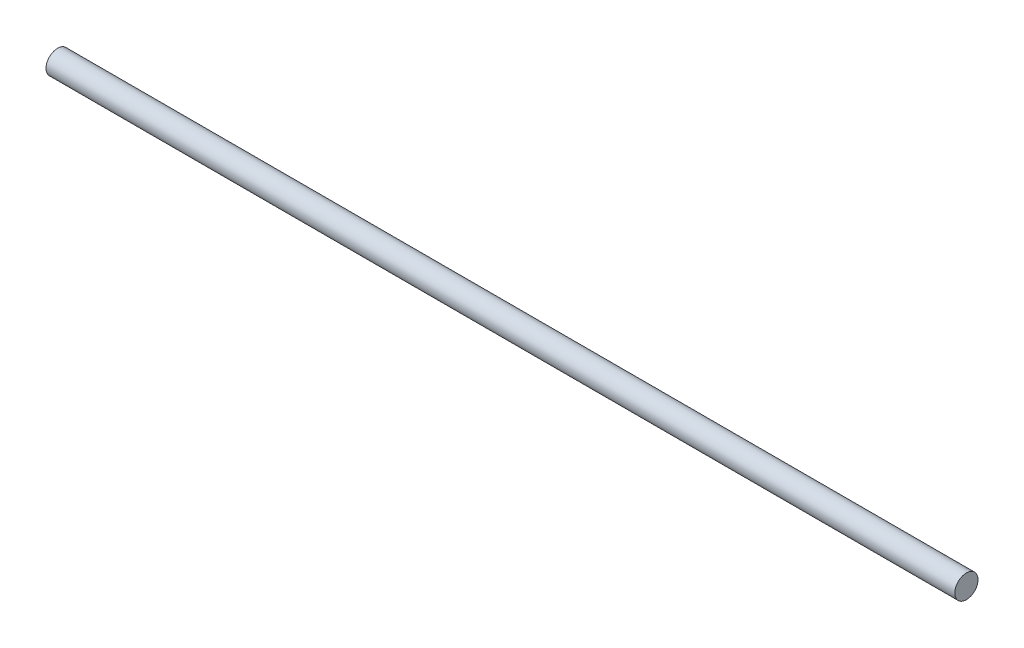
from build123d import *

# Parameters (mm, degrees)
SKETCH1_W = 311.15
SKETCH1_H = 3.9751


with BuildPart() as part:
    # Sketch1 → Revolve1 (revolve)
    with BuildSketch(Plane.XY, mode=Mode.PRIVATE) as revolve1_sk:
        with Locations((155.575, 1.98755)):
            Rectangle(SKETCH1_W, SKETCH1_H)
    revolve(revolve1_sk.sketch.rotate(Axis((311.15, 0, 0), (-1, 0, 0)), 270), axis=Axis((311.15, 0, 0), (-1, 0, 0)))


solid = part.part
